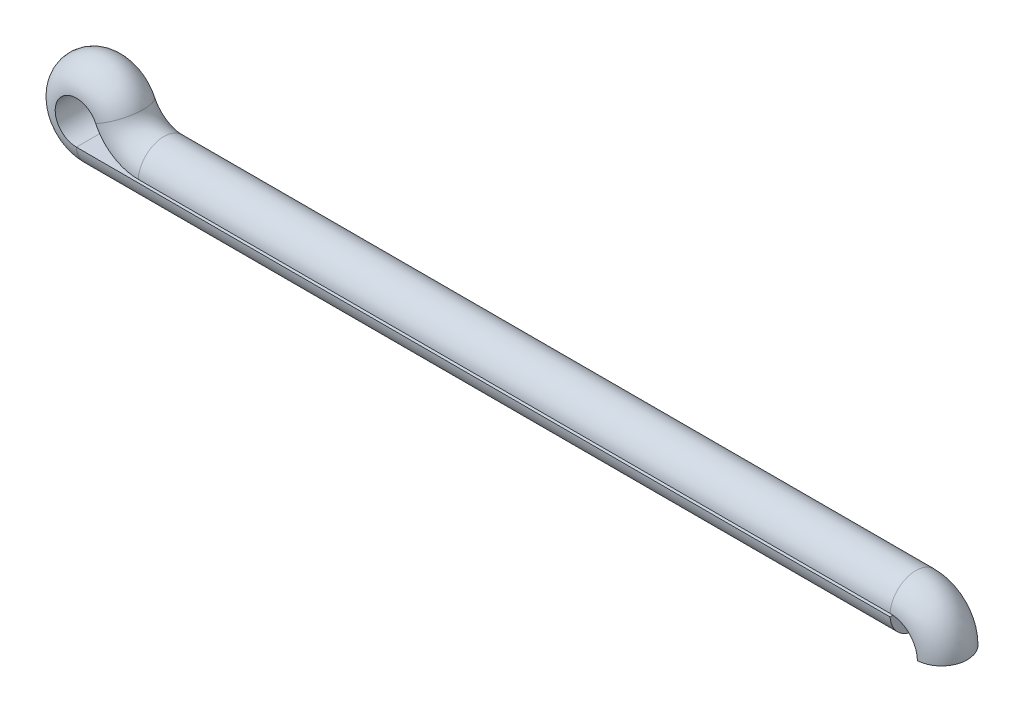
from build123d import *


with BuildPart() as part:
    # Sweep1: sweep along a path in PathSke
    with BuildLine(Plane.XY) as sweep1_path:
        Line((12.601663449, -0.4318), (-1.036120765, -0.4318))
        ThreePointArc((-1.036120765, -0.4318), (-1.678695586, 0.739762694), (-0.345373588, 0.651933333))
        ThreePointArc((-0.345373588, 0.651933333), (-0.204781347, 0.49151259), (0, 0.4318))
        Line((0, 0.4318), (12.601663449, 0.4318))
        ThreePointArc((12.601663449, 0.4318), (13.212320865, 0.178857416), (13.465263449, -0.4318))
    # Sketch2 → Sweep1 (sweep)
    with BuildSketch(Plane(origin=(0, -0.4318, 0), x_dir=(1, 0, 0), z_dir=(0, 1, 0))):
        with BuildLine():
            Line((13.058863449, 0.431052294), (13.058863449, -0.431052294))
            ThreePointArc((13.058863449, -0.431052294), (13.465263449, 0), (13.058863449, 0.431052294))
        make_face()
    sweep(path=sweep1_path.line)


solid = part.part
